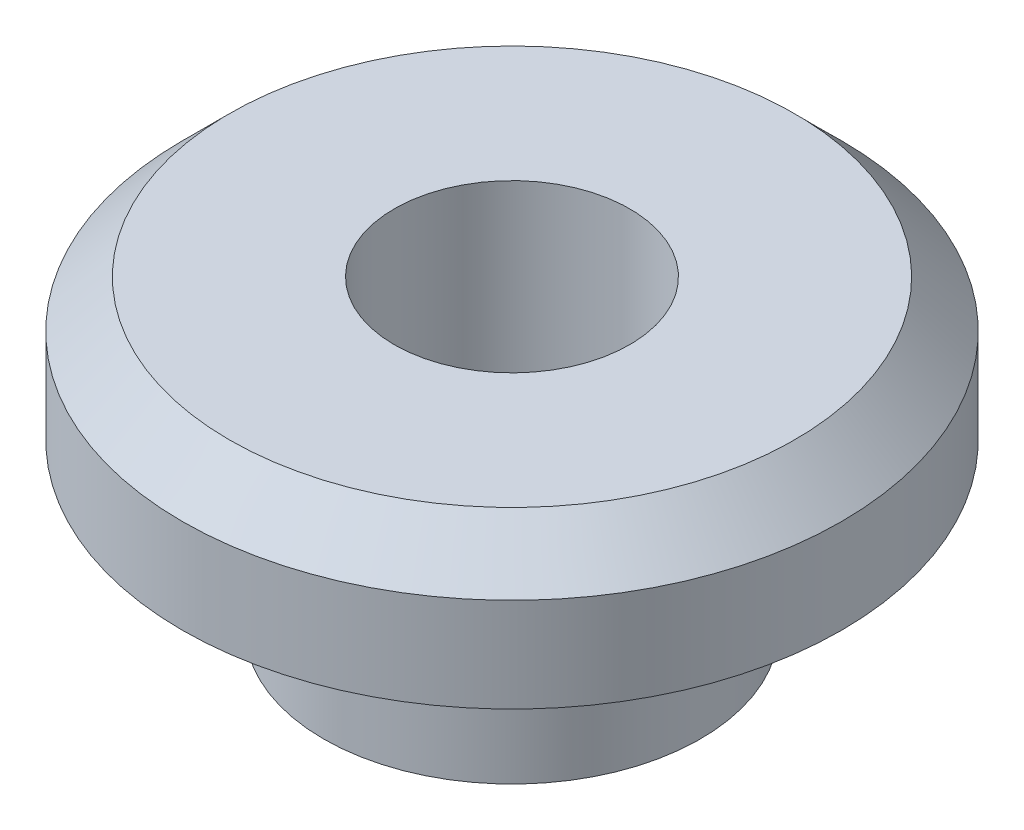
ISO-10303-21;
HEADER;
FILE_DESCRIPTION(('STEP AP214'),'2;1');
FILE_NAME('part.step','',(''),(''),'','','');
FILE_SCHEMA(('AUTOMOTIVE_DESIGN { 1 0 10303 214 1 1 1 1 }'));
ENDSEC;
DATA;
#1=APPLICATION_CONTEXT('core data for automotive mechanical design processes');
#2=APPLICATION_PROTOCOL_DEFINITION('international standard','automotive_design',2000,#1);
#3=PRODUCT_CONTEXT('',#1,'mechanical');
#4=PRODUCT('Part','Part','',(#3));
#5=PRODUCT_RELATED_PRODUCT_CATEGORY('part','',(#4));
#6=PRODUCT_DEFINITION_FORMATION('','',#4);
#7=PRODUCT_DEFINITION_CONTEXT('part definition',#1,'design');
#8=PRODUCT_DEFINITION('design','',#6,#7);
#9=PRODUCT_DEFINITION_SHAPE('','',#8);
#10=(LENGTH_UNIT() NAMED_UNIT(*) SI_UNIT(.MILLI.,.METRE.));
#11=(NAMED_UNIT(*) PLANE_ANGLE_UNIT() SI_UNIT($,.RADIAN.));
#12=(NAMED_UNIT(*) SI_UNIT($,.STERADIAN.) SOLID_ANGLE_UNIT());
#13=UNCERTAINTY_MEASURE_WITH_UNIT(LENGTH_MEASURE(1.E-05),#10,'distance_accuracy_value','');
#14=(GEOMETRIC_REPRESENTATION_CONTEXT(3) GLOBAL_UNCERTAINTY_ASSIGNED_CONTEXT((#13)) GLOBAL_UNIT_ASSIGNED_CONTEXT((#10,
#11,#12)) REPRESENTATION_CONTEXT('',''));
#15=CARTESIAN_POINT('',(0.,0.,0.));
#16=DIRECTION('',(0.,0.,1.));
#17=DIRECTION('',(1.,0.,0.));
#18=AXIS2_PLACEMENT_3D('',#15,#16,#17);
#19=CARTESIAN_POINT('',(0.,3.5,0.));
#20=DIRECTION('',(0.,-1.,0.));
#21=DIRECTION('',(0.,0.,-1.));
#22=AXIS2_PLACEMENT_3D('',#19,#20,#21);
#23=CYLINDRICAL_SURFACE('',#22,4.);
#24=CARTESIAN_POINT('',(0.,3.5,0.));
#25=DIRECTION('',(0.,1.,0.));
#26=DIRECTION('',(0.,0.,1.));
#27=AXIS2_PLACEMENT_3D('',#24,#25,#26);
#28=CIRCLE('',#27,4.);
#29=CARTESIAN_POINT('',(0.,3.5,4.));
#30=VERTEX_POINT('',#29);
#31=EDGE_CURVE('E40',#30,#30,#28,.T.);
#32=ORIENTED_EDGE('',*,*,#31,.F.);
#33=EDGE_LOOP('',(#32));
#34=FACE_BOUND('',#33,.T.);
#35=CARTESIAN_POINT('',(0.,0.,0.));
#36=DIRECTION('',(0.,1.,0.));
#37=DIRECTION('',(0.,0.,1.));
#38=AXIS2_PLACEMENT_3D('',#35,#36,#37);
#39=CIRCLE('',#38,4.);
#40=CARTESIAN_POINT('',(0.,0.,4.));
#41=VERTEX_POINT('',#40);
#42=EDGE_CURVE('E44',#41,#41,#39,.T.);
#43=ORIENTED_EDGE('',*,*,#42,.T.);
#44=EDGE_LOOP('',(#43));
#45=FACE_BOUND('',#44,.T.);
#46=ADVANCED_FACE('F29',(#34,#45),#23,.T.);
#47=CARTESIAN_POINT('',(0.,0.,0.));
#48=DIRECTION('',(0.,1.,0.));
#49=DIRECTION('',(0.,0.,1.));
#50=AXIS2_PLACEMENT_3D('',#47,#48,#49);
#51=PLANE('',#50);
#52=CARTESIAN_POINT('',(0.,0.,0.));
#53=DIRECTION('',(0.,1.,0.));
#54=DIRECTION('',(0.,0.,1.));
#55=AXIS2_PLACEMENT_3D('',#52,#53,#54);
#56=CIRCLE('',#55,2.5);
#57=CARTESIAN_POINT('',(0.,0.,2.5));
#58=VERTEX_POINT('',#57);
#59=EDGE_CURVE('E52',#58,#58,#56,.T.);
#60=ORIENTED_EDGE('',*,*,#59,.T.);
#61=EDGE_LOOP('',(#60));
#62=FACE_BOUND('',#61,.T.);
#63=ORIENTED_EDGE('',*,*,#42,.F.);
#64=EDGE_LOOP('',(#63));
#65=FACE_BOUND('',#64,.T.);
#66=ADVANCED_FACE('F59',(#62,#65),#51,.F.);
#67=CARTESIAN_POINT('',(0.,3.5,0.));
#68=DIRECTION('',(0.,1.,0.));
#69=DIRECTION('',(0.,0.,1.));
#70=AXIS2_PLACEMENT_3D('',#67,#68,#69);
#71=PLANE('',#70);
#72=CARTESIAN_POINT('',(0.,3.5,0.));
#73=DIRECTION('',(0.,1.,0.));
#74=DIRECTION('',(0.,0.,1.));
#75=AXIS2_PLACEMENT_3D('',#72,#73,#74);
#76=CIRCLE('',#75,7.);
#77=CARTESIAN_POINT('',(0.,3.5,7.));
#78=VERTEX_POINT('',#77);
#79=EDGE_CURVE('E48',#78,#78,#76,.T.);
#80=ORIENTED_EDGE('',*,*,#79,.F.);
#81=EDGE_LOOP('',(#80));
#82=FACE_BOUND('',#81,.T.);
#83=ORIENTED_EDGE('',*,*,#31,.T.);
#84=EDGE_LOOP('',(#83));
#85=FACE_BOUND('',#84,.T.);
#86=ADVANCED_FACE('F75',(#82,#85),#71,.F.);
#87=CARTESIAN_POINT('',(0.,6.5,0.));
#88=DIRECTION('',(0.,-1.,0.));
#89=DIRECTION('',(0.,0.,-1.));
#90=AXIS2_PLACEMENT_3D('',#87,#88,#89);
#91=CYLINDRICAL_SURFACE('',#90,7.);
#92=CARTESIAN_POINT('',(0.,5.5,0.));
#93=DIRECTION('',(0.,1.,0.));
#94=DIRECTION('',(0.,0.,1.));
#95=AXIS2_PLACEMENT_3D('',#92,#93,#94);
#96=CIRCLE('',#95,7.);
#97=CARTESIAN_POINT('',(0.,5.5,7.));
#98=VERTEX_POINT('',#97);
#99=EDGE_CURVE('E10',#98,#98,#96,.F.);
#100=ORIENTED_EDGE('',*,*,#99,.T.);
#101=EDGE_LOOP('',(#100));
#102=FACE_BOUND('',#101,.T.);
#103=ORIENTED_EDGE('',*,*,#79,.T.);
#104=EDGE_LOOP('',(#103));
#105=FACE_BOUND('',#104,.T.);
#106=ADVANCED_FACE('F70',(#102,#105),#91,.T.);
#107=CARTESIAN_POINT('',(0.,6.5,0.));
#108=DIRECTION('',(0.,1.,0.));
#109=DIRECTION('',(0.,0.,1.));
#110=AXIS2_PLACEMENT_3D('',#107,#108,#109);
#111=PLANE('',#110);
#112=CARTESIAN_POINT('',(0.,6.5,0.));
#113=DIRECTION('',(0.,1.,0.));
#114=DIRECTION('',(0.,0.,1.));
#115=AXIS2_PLACEMENT_3D('',#112,#113,#114);
#116=CIRCLE('',#115,6.);
#117=CARTESIAN_POINT('',(0.,6.5,6.));
#118=VERTEX_POINT('',#117);
#119=EDGE_CURVE('E36',#118,#118,#116,.T.);
#120=ORIENTED_EDGE('',*,*,#119,.T.);
#121=EDGE_LOOP('',(#120));
#122=FACE_BOUND('',#121,.T.);
#123=CARTESIAN_POINT('',(0.,6.5,0.));
#124=DIRECTION('',(0.,1.,0.));
#125=DIRECTION('',(0.,0.,1.));
#126=AXIS2_PLACEMENT_3D('',#123,#124,#125);
#127=CIRCLE('',#126,2.5);
#128=CARTESIAN_POINT('',(0.,6.5,2.5));
#129=VERTEX_POINT('',#128);
#130=EDGE_CURVE('E53',#129,#129,#127,.T.);
#131=ORIENTED_EDGE('',*,*,#130,.F.);
#132=EDGE_LOOP('',(#131));
#133=FACE_BOUND('',#132,.T.);
#134=ADVANCED_FACE('F65',(#122,#133),#111,.T.);
#135=CARTESIAN_POINT('',(0.,0.,0.));
#136=DIRECTION('',(0.,1.,0.));
#137=DIRECTION('',(0.,0.,1.));
#138=AXIS2_PLACEMENT_3D('',#135,#136,#137);
#139=CYLINDRICAL_SURFACE('',#138,2.5);
#140=ORIENTED_EDGE('',*,*,#59,.F.);
#141=EDGE_LOOP('',(#140));
#142=FACE_BOUND('',#141,.T.);
#143=ORIENTED_EDGE('',*,*,#130,.T.);
#144=EDGE_LOOP('',(#143));
#145=FACE_BOUND('',#144,.T.);
#146=ADVANCED_FACE('F62',(#142,#145),#139,.F.);
#147=CARTESIAN_POINT('',(0.,6.5,0.));
#148=DIRECTION('',(0.,-1.,0.));
#149=DIRECTION('',(0.,0.,-1.));
#150=AXIS2_PLACEMENT_3D('',#147,#148,#149);
#151=CONICAL_SURFACE('',#150,6.,0.785398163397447);
#152=ORIENTED_EDGE('',*,*,#99,.F.);
#153=EDGE_LOOP('',(#152));
#154=FACE_BOUND('',#153,.T.);
#155=ORIENTED_EDGE('',*,*,#119,.F.);
#156=EDGE_LOOP('',(#155));
#157=FACE_BOUND('',#156,.T.);
#158=ADVANCED_FACE('F31',(#154,#157),#151,.T.);
#159=CLOSED_SHELL('',(#46,#66,#86,#106,#134,#146,#158));
#160=MANIFOLD_SOLID_BREP('B2',#159);
#161=ADVANCED_BREP_SHAPE_REPRESENTATION('',(#18,#160),#14);
#162=SHAPE_DEFINITION_REPRESENTATION(#9,#161);
ENDSEC;
END-ISO-10303-21;
